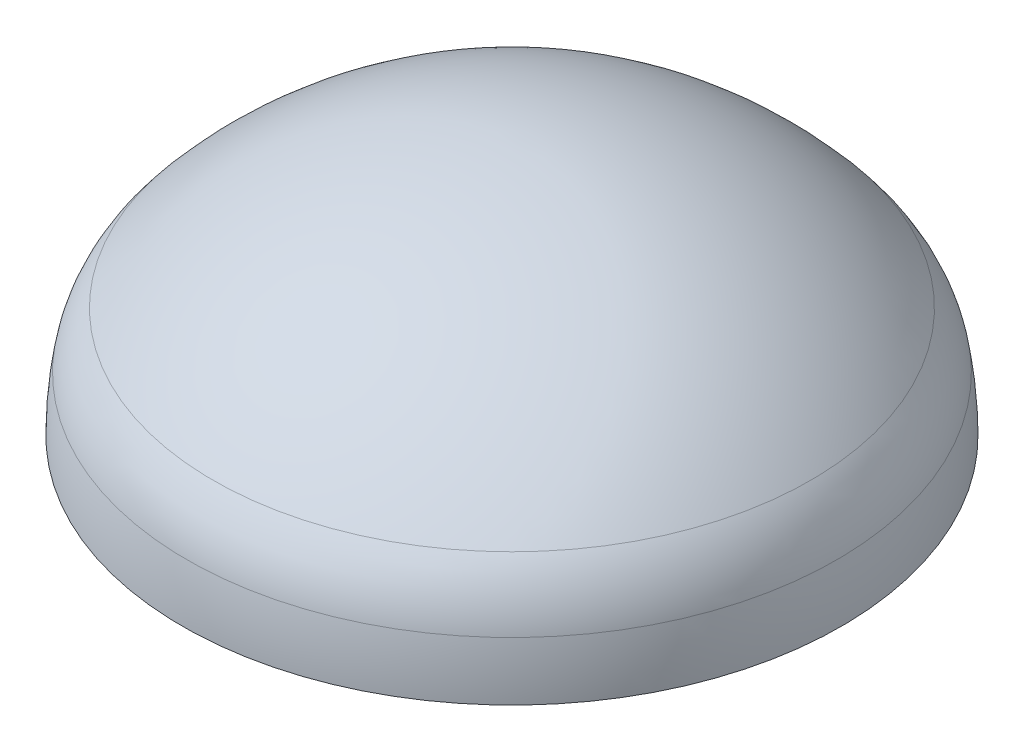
ISO-10303-21;
HEADER;
FILE_DESCRIPTION(('STEP AP214'),'2;1');
FILE_NAME('part.step','',(''),(''),'','','');
FILE_SCHEMA(('AUTOMOTIVE_DESIGN { 1 0 10303 214 1 1 1 1 }'));
ENDSEC;
DATA;
#1=APPLICATION_CONTEXT('core data for automotive mechanical design processes');
#2=APPLICATION_PROTOCOL_DEFINITION('international standard','automotive_design',2000,#1);
#3=PRODUCT_CONTEXT('',#1,'mechanical');
#4=PRODUCT('Part','Part','',(#3));
#5=PRODUCT_RELATED_PRODUCT_CATEGORY('part','',(#4));
#6=PRODUCT_DEFINITION_FORMATION('','',#4);
#7=PRODUCT_DEFINITION_CONTEXT('part definition',#1,'design');
#8=PRODUCT_DEFINITION('design','',#6,#7);
#9=PRODUCT_DEFINITION_SHAPE('','',#8);
#10=(LENGTH_UNIT() NAMED_UNIT(*) SI_UNIT(.MILLI.,.METRE.));
#11=(NAMED_UNIT(*) PLANE_ANGLE_UNIT() SI_UNIT($,.RADIAN.));
#12=(NAMED_UNIT(*) SI_UNIT($,.STERADIAN.) SOLID_ANGLE_UNIT());
#13=UNCERTAINTY_MEASURE_WITH_UNIT(LENGTH_MEASURE(1.E-05),#10,'distance_accuracy_value','');
#14=(GEOMETRIC_REPRESENTATION_CONTEXT(3) GLOBAL_UNCERTAINTY_ASSIGNED_CONTEXT((#13)) GLOBAL_UNIT_ASSIGNED_CONTEXT((#10,
#11,#12)) REPRESENTATION_CONTEXT('',''));
#15=CARTESIAN_POINT('',(0.,0.,0.));
#16=DIRECTION('',(0.,0.,1.));
#17=DIRECTION('',(1.,0.,0.));
#18=AXIS2_PLACEMENT_3D('',#15,#16,#17);
#19=CARTESIAN_POINT('',(0.,-12.5,0.));
#20=DIRECTION('',(0.,-1.,0.));
#21=DIRECTION('',(-1.,0.,0.));
#22=AXIS2_PLACEMENT_3D('',#19,#20,#21);
#23=SPHERICAL_SURFACE('',#22,32.5);
#24=CARTESIAN_POINT('',(0.,8.62499999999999,0.));
#25=DIRECTION('',(0.,-1.,0.));
#26=DIRECTION('',(0.,0.,-1.));
#27=AXIS2_PLACEMENT_3D('',#24,#25,#26);
#28=CIRCLE('',#27,24.6978617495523);
#29=CARTESIAN_POINT('',(0.,8.62499999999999,-24.6978617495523));
#30=VERTEX_POINT('',#29);
#31=EDGE_CURVE('E51',#30,#30,#28,.T.);
#32=ORIENTED_EDGE('',*,*,#31,.T.);
#33=EDGE_LOOP('',(#32));
#34=FACE_BOUND('',#33,.T.);
#35=ADVANCED_FACE('F29',(#34),#23,.F.);
#36=CARTESIAN_POINT('',(0.,-12.5,0.));
#37=DIRECTION('',(0.,-1.,0.));
#38=DIRECTION('',(-1.,0.,0.));
#39=AXIS2_PLACEMENT_3D('',#36,#37,#38);
#40=SPHERICAL_SURFACE('',#39,34.);
#41=CARTESIAN_POINT('',(0.,9.59999999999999,0.));
#42=DIRECTION('',(0.,-1.,0.));
#43=DIRECTION('',(0.,0.,-1.));
#44=AXIS2_PLACEMENT_3D('',#41,#42,#43);
#45=CIRCLE('',#44,25.8377630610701);
#46=CARTESIAN_POINT('',(0.,9.59999999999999,-25.8377630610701));
#47=VERTEX_POINT('',#46);
#48=EDGE_CURVE('E10',#47,#47,#45,.T.);
#49=ORIENTED_EDGE('',*,*,#48,.F.);
#50=EDGE_LOOP('',(#49));
#51=FACE_BOUND('',#50,.T.);
#52=ADVANCED_FACE('F79',(#51),#40,.T.);
#53=CARTESIAN_POINT('',(0.,3.09999999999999,0.));
#54=DIRECTION('',(0.,-1.,0.));
#55=DIRECTION('',(0.,0.,-1.));
#56=AXIS2_PLACEMENT_3D('',#53,#54,#55);
#57=TOROIDAL_SURFACE('',#56,18.2384209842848,10.);
#58=ORIENTED_EDGE('',*,*,#48,.T.);
#59=EDGE_LOOP('',(#58));
#60=FACE_BOUND('',#59,.T.);
#61=CARTESIAN_POINT('',(0.,4.77567567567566,0.));
#62=DIRECTION('',(0.,-1.,0.));
#63=DIRECTION('',(0.,0.,-1.));
#64=AXIS2_PLACEMENT_3D('',#61,#62,#63);
#65=CIRCLE('',#64,28.097026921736);
#66=CARTESIAN_POINT('',(0.,4.77567567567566,-28.097026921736));
#67=VERTEX_POINT('',#66);
#68=EDGE_CURVE('E35',#67,#67,#65,.T.);
#69=ORIENTED_EDGE('',*,*,#68,.F.);
#70=EDGE_LOOP('',(#69));
#71=FACE_BOUND('',#70,.T.);
#72=ADVANCED_FACE('F76',(#60,#71),#57,.T.);
#73=CARTESIAN_POINT('',(0.,0.,0.));
#74=DIRECTION('',(0.,-1.,0.));
#75=DIRECTION('',(-1.,0.,0.));
#76=AXIS2_PLACEMENT_3D('',#73,#74,#75);
#77=SPHERICAL_SURFACE('',#76,28.5);
#78=ORIENTED_EDGE('',*,*,#68,.T.);
#79=EDGE_LOOP('',(#78));
#80=FACE_BOUND('',#79,.T.);
#81=CARTESIAN_POINT('',(0.,0.,0.));
#82=DIRECTION('',(0.,-1.,0.));
#83=DIRECTION('',(0.,0.,-1.));
#84=AXIS2_PLACEMENT_3D('',#81,#82,#83);
#85=CIRCLE('',#84,28.5);
#86=CARTESIAN_POINT('',(0.,0.,-28.5));
#87=VERTEX_POINT('',#86);
#88=EDGE_CURVE('E39',#87,#87,#85,.T.);
#89=ORIENTED_EDGE('',*,*,#88,.F.);
#90=EDGE_LOOP('',(#89));
#91=FACE_BOUND('',#90,.T.);
#92=ADVANCED_FACE('F70',(#80,#91),#77,.T.);
#93=CARTESIAN_POINT('',(-27.,0.,0.));
#94=DIRECTION('',(0.,-1.,0.));
#95=DIRECTION('',(0.,0.,-1.));
#96=AXIS2_PLACEMENT_3D('',#93,#94,#95);
#97=PLANE('',#96);
#98=ORIENTED_EDGE('',*,*,#88,.T.);
#99=EDGE_LOOP('',(#98));
#100=FACE_BOUND('',#99,.T.);
#101=CARTESIAN_POINT('',(0.,0.,0.));
#102=DIRECTION('',(0.,-1.,0.));
#103=DIRECTION('',(0.,0.,-1.));
#104=AXIS2_PLACEMENT_3D('',#101,#102,#103);
#105=CIRCLE('',#104,27.);
#106=CARTESIAN_POINT('',(0.,0.,-27.));
#107=VERTEX_POINT('',#106);
#108=EDGE_CURVE('E43',#107,#107,#105,.T.);
#109=ORIENTED_EDGE('',*,*,#108,.F.);
#110=EDGE_LOOP('',(#109));
#111=FACE_BOUND('',#110,.T.);
#112=ADVANCED_FACE('F65',(#100,#111),#97,.T.);
#113=CARTESIAN_POINT('',(0.,0.,0.));
#114=DIRECTION('',(0.,-1.,0.));
#115=DIRECTION('',(-1.,0.,0.));
#116=AXIS2_PLACEMENT_3D('',#113,#114,#115);
#117=SPHERICAL_SURFACE('',#116,27.);
#118=CARTESIAN_POINT('',(0.,4.52432432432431,0.));
#119=DIRECTION('',(0.,-1.,0.));
#120=DIRECTION('',(0.,0.,-1.));
#121=AXIS2_PLACEMENT_3D('',#118,#119,#120);
#122=CIRCLE('',#121,26.6182360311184);
#123=CARTESIAN_POINT('',(0.,4.52432432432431,-26.6182360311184));
#124=VERTEX_POINT('',#123);
#125=EDGE_CURVE('E48',#124,#124,#122,.T.);
#126=ORIENTED_EDGE('',*,*,#125,.F.);
#127=EDGE_LOOP('',(#126));
#128=FACE_BOUND('',#127,.T.);
#129=ORIENTED_EDGE('',*,*,#108,.T.);
#130=EDGE_LOOP('',(#129));
#131=FACE_BOUND('',#130,.T.);
#132=ADVANCED_FACE('F59',(#128,#131),#117,.F.);
#133=CARTESIAN_POINT('',(0.,3.09999999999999,0.));
#134=DIRECTION('',(0.,-1.,0.));
#135=DIRECTION('',(0.,0.,-1.));
#136=AXIS2_PLACEMENT_3D('',#133,#134,#135);
#137=TOROIDAL_SURFACE('',#136,18.2384209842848,8.5);
#138=ORIENTED_EDGE('',*,*,#31,.F.);
#139=EDGE_LOOP('',(#138));
#140=FACE_BOUND('',#139,.T.);
#141=ORIENTED_EDGE('',*,*,#125,.T.);
#142=EDGE_LOOP('',(#141));
#143=FACE_BOUND('',#142,.T.);
#144=ADVANCED_FACE('F56',(#140,#143),#137,.F.);
#145=CLOSED_SHELL('',(#35,#52,#72,#92,#112,#132,#144));
#146=MANIFOLD_SOLID_BREP('B2',#145);
#147=ADVANCED_BREP_SHAPE_REPRESENTATION('',(#18,#146),#14);
#148=SHAPE_DEFINITION_REPRESENTATION(#9,#147);
ENDSEC;
END-ISO-10303-21;
